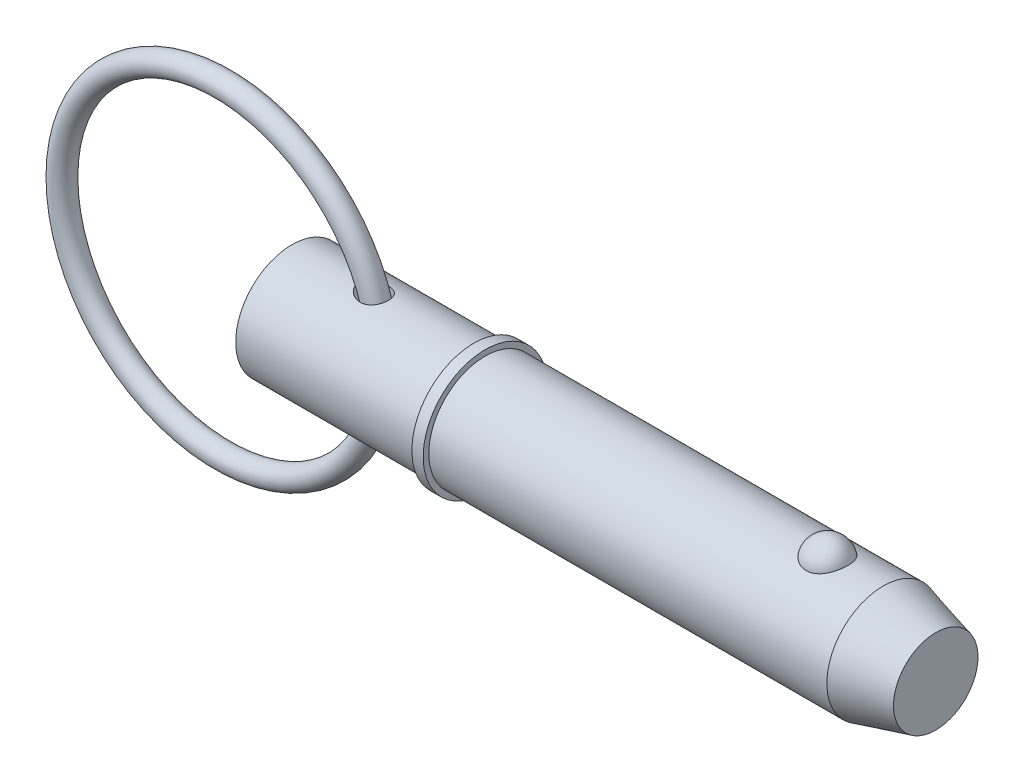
ISO-10303-21;
HEADER;
FILE_DESCRIPTION(('STEP AP214'),'2;1');
FILE_NAME('part.step','',(''),(''),'','','');
FILE_SCHEMA(('AUTOMOTIVE_DESIGN { 1 0 10303 214 1 1 1 1 }'));
ENDSEC;
DATA;
#1=APPLICATION_CONTEXT('core data for automotive mechanical design processes');
#2=APPLICATION_PROTOCOL_DEFINITION('international standard','automotive_design',2000,#1);
#3=PRODUCT_CONTEXT('',#1,'mechanical');
#4=PRODUCT('Part','Part','',(#3));
#5=PRODUCT_RELATED_PRODUCT_CATEGORY('part','',(#4));
#6=PRODUCT_DEFINITION_FORMATION('','',#4);
#7=PRODUCT_DEFINITION_CONTEXT('part definition',#1,'design');
#8=PRODUCT_DEFINITION('design','',#6,#7);
#9=PRODUCT_DEFINITION_SHAPE('','',#8);
#10=(LENGTH_UNIT() NAMED_UNIT(*) SI_UNIT(.MILLI.,.METRE.));
#11=(NAMED_UNIT(*) PLANE_ANGLE_UNIT() SI_UNIT($,.RADIAN.));
#12=(NAMED_UNIT(*) SI_UNIT($,.STERADIAN.) SOLID_ANGLE_UNIT());
#13=UNCERTAINTY_MEASURE_WITH_UNIT(LENGTH_MEASURE(1.E-05),#10,'distance_accuracy_value','');
#14=(GEOMETRIC_REPRESENTATION_CONTEXT(3) GLOBAL_UNCERTAINTY_ASSIGNED_CONTEXT((#13)) GLOBAL_UNIT_ASSIGNED_CONTEXT((#10,
#11,#12)) REPRESENTATION_CONTEXT('',''));
#15=CARTESIAN_POINT('',(0.,0.,0.));
#16=DIRECTION('',(0.,0.,1.));
#17=DIRECTION('',(1.,0.,0.));
#18=AXIS2_PLACEMENT_3D('',#15,#16,#17);
#19=CARTESIAN_POINT('',(-13.640845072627,0.,0.));
#20=DIRECTION('',(0.,0.,1.));
#21=DIRECTION('',(1.,0.,0.));
#22=AXIS2_PLACEMENT_3D('',#19,#20,#21);
#23=TOROIDAL_SURFACE('',#22,31.75,2.223);
#24=CARTESIAN_POINT('',(20.332154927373,0.,0.));
#25=VERTEX_POINT('',#24);
#26=VERTEX_LOOP('',#25);
#27=FACE_BOUND('',#26,.T.);
#28=ADVANCED_FACE('P0_F12',(#27),#23,.T.);
#29=CLOSED_SHELL('',(#28));
#30=MANIFOLD_SOLID_BREP('P0_B1',#29);
#31=CARTESIAN_POINT('',(0.,0.,0.));
#32=DIRECTION('',(1.,0.,0.));
#33=DIRECTION('',(0.,0.,-1.));
#34=AXIS2_PLACEMENT_3D('',#31,#32,#33);
#35=CYLINDRICAL_SURFACE('',#34,11.115);
#36=CARTESIAN_POINT('',(13.5245830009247,11.0328953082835,-1.34849772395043));
#37=CARTESIAN_POINT('',(13.6190616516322,11.0150940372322,-1.49413162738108));
#38=CARTESIAN_POINT('',(13.7272589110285,10.9954577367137,-1.63076546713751));
#39=CARTESIAN_POINT('',(13.9654537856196,10.9550099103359,-1.8834727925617));
#40=CARTESIAN_POINT('',(14.0954990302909,10.9341958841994,-1.99950019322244));
#41=CARTESIAN_POINT('',(14.3718600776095,10.893854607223,-2.20871939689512));
#42=CARTESIAN_POINT('',(14.5180879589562,10.8743212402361,-2.30202655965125));
#43=CARTESIAN_POINT('',(14.8233821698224,10.8385071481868,-2.46515115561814));
#44=CARTESIAN_POINT('',(14.9824448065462,10.8222254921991,-2.53497531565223));
#45=CARTESIAN_POINT('',(15.3233581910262,10.7936101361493,-2.65430007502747));
#46=CARTESIAN_POINT('',(15.5060064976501,10.7817126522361,-2.7016502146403));
#47=CARTESIAN_POINT('',(15.8771124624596,10.7657570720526,-2.76455948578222));
#48=CARTESIAN_POINT('',(16.0655695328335,10.7616981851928,-2.78012182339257));
#49=CARTESIAN_POINT('',(16.4345152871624,10.7624400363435,-2.77724928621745));
#50=CARTESIAN_POINT('',(16.6150121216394,10.7668823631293,-2.76018977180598));
#51=CARTESIAN_POINT('',(16.9695132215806,10.7837407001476,-2.69357457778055));
#52=CARTESIAN_POINT('',(17.1435222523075,10.7961507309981,-2.64404326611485));
#53=CARTESIAN_POINT('',(17.4621418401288,10.8258984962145,-2.51928348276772));
#54=CARTESIAN_POINT('',(17.6079677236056,10.8426430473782,-2.44700611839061));
#55=CARTESIAN_POINT('',(17.884162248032,10.8794194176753,-2.27791740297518));
#56=CARTESIAN_POINT('',(18.0145349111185,10.8994503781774,-2.18111245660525));
#57=CARTESIAN_POINT('',(18.2494965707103,10.9392822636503,-1.9713196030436));
#58=CARTESIAN_POINT('',(18.3550661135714,10.9590421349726,-1.85941863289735));
#59=CARTESIAN_POINT('',(18.5458147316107,10.9970986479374,-1.61919918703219));
#60=CARTESIAN_POINT('',(18.6309947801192,11.0153953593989,-1.49088149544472));
#61=CARTESIAN_POINT('',(18.7786686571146,11.0484675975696,-1.2218388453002));
#62=CARTESIAN_POINT('',(18.8412214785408,11.063252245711,-1.08114735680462));
#63=CARTESIAN_POINT('',(18.9425265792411,11.0877718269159,-0.791025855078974));
#64=CARTESIAN_POINT('',(18.9812780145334,11.0975065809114,-0.641595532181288));
#65=CARTESIAN_POINT('',(19.0343305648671,11.1109435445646,-0.336997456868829));
#66=CARTESIAN_POINT('',(19.0484404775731,11.1145985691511,-0.181794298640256));
#67=CARTESIAN_POINT('',(19.0513147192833,11.1153384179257,0.1288646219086));
#68=CARTESIAN_POINT('',(19.0400783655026,11.112423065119,0.284320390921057));
#69=CARTESIAN_POINT('',(18.9924362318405,11.1003163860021,0.591525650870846));
#70=CARTESIAN_POINT('',(18.9559600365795,11.0911075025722,0.743263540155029));
#71=CARTESIAN_POINT('',(18.858576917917,11.0673920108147,1.03825247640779));
#72=CARTESIAN_POINT('',(18.7976699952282,11.0528854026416,1.18150352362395));
#73=CARTESIAN_POINT('',(18.6529960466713,11.020201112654,1.45511394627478));
#74=CARTESIAN_POINT('',(18.5692772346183,11.0020311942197,1.58549973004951));
#75=CARTESIAN_POINT('',(18.3810003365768,10.9640237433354,1.82995492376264));
#76=CARTESIAN_POINT('',(18.2764441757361,10.9441863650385,1.9440258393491));
#77=CARTESIAN_POINT('',(18.0501398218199,10.9052267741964,2.15183128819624));
#78=CARTESIAN_POINT('',(17.9285270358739,10.8861003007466,2.24571250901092));
#79=CARTESIAN_POINT('',(17.6709592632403,10.8505244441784,2.41175942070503));
#80=CARTESIAN_POINT('',(17.5350055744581,10.8340748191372,2.48392707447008));
#81=CARTESIAN_POINT('',(17.2528390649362,10.8056099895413,2.60497667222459));
#82=CARTESIAN_POINT('',(17.1066353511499,10.7935909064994,2.65387899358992));
#83=CARTESIAN_POINT('',(16.8080326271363,10.7750969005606,2.72799859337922));
#84=CARTESIAN_POINT('',(16.6556326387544,10.7686228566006,2.75321211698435));
#85=CARTESIAN_POINT('',(16.3428877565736,10.761517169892,2.78086153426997));
#86=CARTESIAN_POINT('',(16.1824599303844,10.7611149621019,2.78240297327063));
#87=CARTESIAN_POINT('',(15.863296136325,10.766478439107,2.76156874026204));
#88=CARTESIAN_POINT('',(15.7045607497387,10.7722461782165,2.73918510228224));
#89=CARTESIAN_POINT('',(15.3787211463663,10.7898500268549,2.66904167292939));
#90=CARTESIAN_POINT('',(15.2120794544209,10.8021675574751,2.6192557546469));
#91=CARTESIAN_POINT('',(14.8886284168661,10.8315482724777,2.4949635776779));
#92=CARTESIAN_POINT('',(14.731827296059,10.8486153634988,2.42043695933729));
#93=CARTESIAN_POINT('',(14.4198762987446,10.8870804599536,2.24137362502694));
#94=CARTESIAN_POINT('',(14.2658484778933,10.9087148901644,2.13492229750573));
#95=CARTESIAN_POINT('',(13.9788214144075,10.9526299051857,1.89676517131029));
#96=CARTESIAN_POINT('',(13.845804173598,10.9749099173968,1.76508120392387));
#97=CARTESIAN_POINT('',(13.6310853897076,11.012885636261,1.50762337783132));
#98=CARTESIAN_POINT('',(13.5444453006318,11.0290026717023,1.38602082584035));
#99=CARTESIAN_POINT('',(13.392158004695,11.0581740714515,1.12983363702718));
#100=CARTESIAN_POINT('',(13.3264946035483,11.0712307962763,0.995259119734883));
#101=CARTESIAN_POINT('',(13.2464179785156,11.0874250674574,0.785640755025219));
#102=CARTESIAN_POINT('',(13.2227369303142,11.0922707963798,0.71416661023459));
#103=CARTESIAN_POINT('',(13.1820656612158,11.1006486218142,0.56927708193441));
#104=CARTESIAN_POINT('',(13.1650721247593,11.1041813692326,0.495862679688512));
#105=CARTESIAN_POINT('',(13.1381118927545,11.1098070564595,0.34771199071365));
#106=CARTESIAN_POINT('',(13.1281436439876,11.1119003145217,0.272975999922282));
#107=CARTESIAN_POINT('',(13.1154243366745,11.1145746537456,0.122890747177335));
#108=CARTESIAN_POINT('',(13.1126723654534,11.1151559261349,0.0475415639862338));
#109=CARTESIAN_POINT('',(13.1151602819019,11.1146296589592,-0.160384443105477));
#110=CARTESIAN_POINT('',(13.128061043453,11.111903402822,-0.292944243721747));
#111=CARTESIAN_POINT('',(13.175691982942,11.1019662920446,-0.553751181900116));
#112=CARTESIAN_POINT('',(13.2104121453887,11.094757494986,-0.682000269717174));
#113=CARTESIAN_POINT('',(13.2891255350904,11.0787645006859,-0.901873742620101));
#114=CARTESIAN_POINT('',(13.3290466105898,11.0707438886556,-0.995044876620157));
#115=CARTESIAN_POINT('',(13.4192915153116,11.0529876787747,-1.175992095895));
#116=CARTESIAN_POINT('',(13.4696154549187,11.0432520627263,-1.26376812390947));
#117=CARTESIAN_POINT('',(13.5245830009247,11.0328953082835,-1.34849772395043));
#118=B_SPLINE_CURVE_WITH_KNOTS('',3,(#36,#37,#38,#39,#40,#41,#42,#43,#44,#45,#46,#47,#48,#49,
#50,#51,#52,#53,#54,#55,#56,#57,#58,#59,#60,#61,#62,#63,#64,#65,#66,#67,#68,#69,#70,#71,#72,#73,
#74,#75,#76,#77,#78,#79,#80,#81,#82,#83,#84,#85,#86,#87,#88,#89,#90,#91,#92,#93,#94,#95,#96,#97,
#98,#99,#100,#101,#102,#103,#104,#105,#106,#107,#108,#109,#110,#111,#112,#113,#114,#115,#116,
#117),.UNSPECIFIED.,.T.,.F.,(4,2,2,2,2,2,2,2,2,2,2,2,2,2,2,2,2,2,2,2,2,2,2,2,2,2,2,2,2,2,2,2,2,
2,2,2,2,2,2,2,4),(0.,0.523099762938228,1.04735506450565,1.5688902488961,2.09027590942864,
2.65465173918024,3.21897064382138,3.76002078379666,4.30066536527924,4.78898318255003,
5.27717362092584,5.74028268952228,6.20336964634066,6.66524040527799,7.12712754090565,
7.59258295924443,8.05805091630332,8.52482272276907,8.99159451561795,9.45738731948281,
9.92313710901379,10.3853792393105,10.8475795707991,11.3093743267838,11.771242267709,
12.2505208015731,12.7299589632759,13.2508366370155,13.7721440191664,14.334890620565,
14.8971525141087,15.3459336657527,15.7943675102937,16.0204422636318,16.2464047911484,
16.4723173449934,16.6982013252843,17.095711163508,17.4930386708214,17.7973741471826,
18.1017128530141),.UNSPECIFIED.);
#119=CARTESIAN_POINT('',(13.5245830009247,11.0328953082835,-1.34849772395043));
#120=VERTEX_POINT('',#119);
#121=EDGE_CURVE('P1_E42',#120,#120,#118,.T.);
#122=ORIENTED_EDGE('',*,*,#121,.T.);
#123=EDGE_LOOP('',(#122));
#124=FACE_BOUND('',#123,.T.);
#125=CARTESIAN_POINT('',(0.,0.,0.));
#126=DIRECTION('',(1.,0.,0.));
#127=DIRECTION('',(0.,0.,-1.));
#128=AXIS2_PLACEMENT_3D('',#125,#126,#127);
#129=CIRCLE('',#128,11.115);
#130=CARTESIAN_POINT('',(0.,0.,-11.115));
#131=VERTEX_POINT('',#130);
#132=EDGE_CURVE('P1_E9',#131,#131,#129,.T.);
#133=ORIENTED_EDGE('',*,*,#132,.T.);
#134=EDGE_LOOP('',(#133));
#135=FACE_BOUND('',#134,.T.);
#136=CARTESIAN_POINT('',(35.877,0.,0.));
#137=DIRECTION('',(1.,0.,0.));
#138=DIRECTION('',(0.,0.,-1.));
#139=AXIS2_PLACEMENT_3D('',#136,#137,#138);
#140=CIRCLE('',#139,11.115);
#141=CARTESIAN_POINT('',(35.877,0.,-11.115));
#142=VERTEX_POINT('',#141);
#143=EDGE_CURVE('P1_E25',#142,#142,#140,.T.);
#144=ORIENTED_EDGE('',*,*,#143,.F.);
#145=EDGE_LOOP('',(#144));
#146=FACE_BOUND('',#145,.T.);
#147=CARTESIAN_POINT('',(13.5245830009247,-11.0328953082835,-1.34849772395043));
#148=CARTESIAN_POINT('',(13.449887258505,-11.0469690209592,-1.233356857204));
#149=CARTESIAN_POINT('',(13.3837464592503,-11.0598986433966,-1.11255897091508));
#150=CARTESIAN_POINT('',(13.271526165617,-11.0822620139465,-0.861680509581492));
#151=CARTESIAN_POINT('',(13.2254273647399,-11.0916991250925,-0.731609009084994));
#152=CARTESIAN_POINT('',(13.1557497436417,-11.1060943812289,-0.464578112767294));
#153=CARTESIAN_POINT('',(13.1322820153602,-11.111030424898,-0.327588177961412));
#154=CARTESIAN_POINT('',(13.1098958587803,-11.1157368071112,-0.0515139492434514));
#155=CARTESIAN_POINT('',(13.1109730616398,-11.1155080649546,0.087569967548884));
#156=CARTESIAN_POINT('',(13.1367722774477,-11.110088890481,0.354927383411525));
#157=CARTESIAN_POINT('',(13.160070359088,-11.1051972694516,0.483348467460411));
#158=CARTESIAN_POINT('',(13.2268311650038,-11.091413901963,0.734581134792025));
#159=CARTESIAN_POINT('',(13.2702981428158,-11.0825213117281,0.857391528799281));
#160=CARTESIAN_POINT('',(13.3769008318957,-11.0612491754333,1.09871322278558));
#161=CARTESIAN_POINT('',(13.4406446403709,-11.048763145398,1.21694419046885));
#162=CARTESIAN_POINT('',(13.5844860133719,-11.0215642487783,1.44267020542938));
#163=CARTESIAN_POINT('',(13.6645903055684,-11.0068504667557,1.55016080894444));
#164=CARTESIAN_POINT('',(13.8511803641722,-10.9741237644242,1.76795565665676));
#165=CARTESIAN_POINT('',(13.959808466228,-10.9559422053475,1.87639683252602));
#166=CARTESIAN_POINT('',(14.1916437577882,-10.9197998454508,2.07642617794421));
#167=CARTESIAN_POINT('',(14.3148607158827,-10.901839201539,2.16800294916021));
#168=CARTESIAN_POINT('',(14.5931107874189,-10.8649902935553,2.34622033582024));
#169=CARTESIAN_POINT('',(14.7501095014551,-10.8463937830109,2.42986679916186));
#170=CARTESIAN_POINT('',(15.0757118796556,-10.8136392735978,2.57171975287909));
#171=CARTESIAN_POINT('',(15.2443214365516,-10.7994835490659,2.62991321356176));
#172=CARTESIAN_POINT('',(15.599068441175,-10.7767894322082,2.72147498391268));
#173=CARTESIAN_POINT('',(15.7856559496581,-10.768622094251,2.75321798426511));
#174=CARTESIAN_POINT('',(16.1617095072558,-10.7608206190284,2.78356776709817));
#175=CARTESIAN_POINT('',(16.3511739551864,-10.7611818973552,2.78219235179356));
#176=CARTESIAN_POINT('',(16.7138126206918,-10.7705428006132,2.7457129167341));
#177=CARTESIAN_POINT('',(16.8872269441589,-10.7789612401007,2.71287798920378));
#178=CARTESIAN_POINT('',(17.2247245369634,-10.8028011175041,2.61632772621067));
#179=CARTESIAN_POINT('',(17.3888134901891,-10.8182182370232,2.55263143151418));
#180=CARTESIAN_POINT('',(17.6871641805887,-10.8524191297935,2.40281428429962));
#181=CARTESIAN_POINT('',(17.8227812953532,-10.8707652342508,2.31928155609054));
#182=CARTESIAN_POINT('',(18.0770765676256,-10.9094513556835,2.12988301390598));
#183=CARTESIAN_POINT('',(18.1957578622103,-10.9297910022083,2.02402134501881));
#184=CARTESIAN_POINT('',(18.4088055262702,-10.9693230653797,1.79719870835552));
#185=CARTESIAN_POINT('',(18.5038890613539,-10.9885305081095,1.67691225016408));
#186=CARTESIAN_POINT('',(18.6726701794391,-11.0244347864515,1.42183894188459));
#187=CARTESIAN_POINT('',(18.7463681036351,-11.0411316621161,1.28705232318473));
#188=CARTESIAN_POINT('',(18.8708297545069,-11.0702507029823,1.00634471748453));
#189=CARTESIAN_POINT('',(18.9215212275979,-11.0826593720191,0.860390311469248));
#190=CARTESIAN_POINT('',(18.9984973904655,-11.1017993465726,0.561823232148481));
#191=CARTESIAN_POINT('',(19.0247811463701,-11.1085304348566,0.409210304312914));
#192=CARTESIAN_POINT('',(19.0524622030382,-11.1156244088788,0.100537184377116));
#193=CARTESIAN_POINT('',(19.0536873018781,-11.1159432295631,-0.0555394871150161));
#194=CARTESIAN_POINT('',(19.0307837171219,-11.110065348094,-0.365700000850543));
#195=CARTESIAN_POINT('',(19.0066544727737,-11.1038685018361,-0.519783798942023));
#196=CARTESIAN_POINT('',(18.9335163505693,-11.0856111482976,-0.821817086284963));
#197=CARTESIAN_POINT('',(18.8844701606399,-11.0735418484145,-0.969757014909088));
#198=CARTESIAN_POINT('',(18.7625929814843,-11.0448501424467,-1.25502066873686));
#199=CARTESIAN_POINT('',(18.6897623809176,-11.0282278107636,-1.39234456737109));
#200=CARTESIAN_POINT('',(18.522359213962,-10.9923333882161,-1.65195905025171));
#201=CARTESIAN_POINT('',(18.427863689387,-10.9730707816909,-1.77430060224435));
#202=CARTESIAN_POINT('',(18.2194216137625,-10.9340072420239,-2.00099176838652));
#203=CARTESIAN_POINT('',(18.1054772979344,-10.9142063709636,-2.10534344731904));
#204=CARTESIAN_POINT('',(17.8622613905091,-10.8764452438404,-2.2924289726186));
#205=CARTESIAN_POINT('',(17.7331196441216,-10.8584715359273,-2.3753290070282));
#206=CARTESIAN_POINT('',(17.4625069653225,-10.8261386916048,-2.51860389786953));
#207=CARTESIAN_POINT('',(17.3210365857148,-10.8117793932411,-2.57897976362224));
#208=CARTESIAN_POINT('',(17.0290309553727,-10.7880576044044,-2.67648805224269));
#209=CARTESIAN_POINT('',(16.8784484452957,-10.7787241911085,-2.71348542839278));
#210=CARTESIAN_POINT('',(16.573148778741,-10.7659618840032,-2.7636855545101));
#211=CARTESIAN_POINT('',(16.4184306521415,-10.7625343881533,-2.77688267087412));
#212=CARTESIAN_POINT('',(16.1008073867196,-10.761643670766,-2.78033419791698));
#213=CARTESIAN_POINT('',(15.9378898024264,-10.7644957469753,-2.76937572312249));
#214=CARTESIAN_POINT('',(15.6157286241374,-10.7762062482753,-2.72344300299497));
#215=CARTESIAN_POINT('',(15.4564861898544,-10.7850665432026,-2.68846128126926));
#216=CARTESIAN_POINT('',(15.1305734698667,-10.808737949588,-2.59174021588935));
#217=CARTESIAN_POINT('',(14.9645834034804,-10.8240246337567,-2.52782071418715));
#218=CARTESIAN_POINT('',(14.6448218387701,-10.8585969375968,-2.37491543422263));
#219=CARTESIAN_POINT('',(14.4910653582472,-10.8778873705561,-2.28589943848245));
#220=CARTESIAN_POINT('',(14.1837929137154,-10.920550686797,-2.07312951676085));
#221=CARTESIAN_POINT('',(14.0321999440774,-10.9441390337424,-1.94661563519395));
#222=CARTESIAN_POINT('',(13.756115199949,-10.9902311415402,-1.66673537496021));
#223=CARTESIAN_POINT('',(13.6315733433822,-11.0127368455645,-1.51341958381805));
#224=CARTESIAN_POINT('',(13.5245830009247,-11.0328953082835,-1.34849772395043));
#225=B_SPLINE_CURVE_WITH_KNOTS('',3,(#147,#148,#149,#150,#151,#152,#153,#154,#155,#156,#157,
#158,#159,#160,#161,#162,#163,#164,#165,#166,#167,#168,#169,#170,#171,#172,#173,#174,#175,#176,
#177,#178,#179,#180,#181,#182,#183,#184,#185,#186,#187,#188,#189,#190,#191,#192,#193,#194,#195,
#196,#197,#198,#199,#200,#201,#202,#203,#204,#205,#206,#207,#208,#209,#210,#211,#212,#213,#214,
#215,#216,#217,#218,#219,#220,#221,#222,#223,#224),.UNSPECIFIED.,.T.,.F.,(4,2,2,2,2,2,2,2,2,2,2,
2,2,2,2,2,2,2,2,2,2,2,2,2,2,2,2,2,2,2,2,2,2,2,2,2,2,2,4),(0.,0.413394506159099,
0.826389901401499,1.24140245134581,1.65634113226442,2.04635967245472,2.43646050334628,
2.83958259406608,3.24287078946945,3.70479277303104,4.16702582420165,4.70130512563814,
5.23585761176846,5.80123945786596,6.36631739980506,6.89348344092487,7.42032464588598,
7.8989135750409,8.37741373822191,8.83881993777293,9.30021877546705,9.76305681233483,
10.2259125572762,10.6919479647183,11.1579936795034,11.6247393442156,12.0914773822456,
12.55658073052,13.0216306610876,13.4829619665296,13.9442725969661,14.408224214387,
14.8722856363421,15.3601762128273,15.8482186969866,16.3815107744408,16.9154477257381,
17.5086806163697,18.1008056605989),.UNSPECIFIED.);
#226=CARTESIAN_POINT('',(13.5245830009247,-11.0328953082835,-1.34849772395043));
#227=VERTEX_POINT('',#226);
#228=EDGE_CURVE('P1_E17',#227,#227,#225,.T.);
#229=ORIENTED_EDGE('',*,*,#228,.T.);
#230=EDGE_LOOP('',(#229));
#231=FACE_BOUND('',#230,.T.);
#232=ADVANCED_FACE('P1_F13',(#124,#135,#146,#231),#35,.T.);
#233=CARTESIAN_POINT('',(0.,0.,0.));
#234=DIRECTION('',(1.,0.,0.));
#235=DIRECTION('',(0.,0.,-1.));
#236=AXIS2_PLACEMENT_3D('',#233,#234,#235);
#237=CYLINDRICAL_SURFACE('',#236,11.115);
#238=CARTESIAN_POINT('',(116.629563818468,0.,0.));
#239=DIRECTION('',(1.,0.,0.));
#240=DIRECTION('',(0.,0.,-1.));
#241=AXIS2_PLACEMENT_3D('',#238,#239,#240);
#242=CIRCLE('',#241,11.115);
#243=CARTESIAN_POINT('',(116.629563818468,0.,-11.115));
#244=VERTEX_POINT('',#243);
#245=EDGE_CURVE('P1_E99',#244,#244,#242,.T.);
#246=ORIENTED_EDGE('',*,*,#245,.F.);
#247=EDGE_LOOP('',(#246));
#248=FACE_BOUND('',#247,.T.);
#249=CARTESIAN_POINT('',(38.1,0.,0.));
#250=DIRECTION('',(1.,0.,0.));
#251=DIRECTION('',(0.,0.,-1.));
#252=AXIS2_PLACEMENT_3D('',#249,#250,#251);
#253=CIRCLE('',#252,11.115);
#254=CARTESIAN_POINT('',(38.1,0.,-11.115));
#255=VERTEX_POINT('',#254);
#256=EDGE_CURVE('P1_E96',#255,#255,#253,.T.);
#257=ORIENTED_EDGE('',*,*,#256,.T.);
#258=EDGE_LOOP('',(#257));
#259=FACE_BOUND('',#258,.T.);
#260=CARTESIAN_POINT('',(105.631068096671,10.3028087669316,4.17077409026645));
#261=CARTESIAN_POINT('',(105.414775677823,10.3028003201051,4.17078240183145));
#262=CARTESIAN_POINT('',(105.198548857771,10.3098895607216,4.15340593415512));
#263=CARTESIAN_POINT('',(104.772540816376,10.3373834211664,4.08449540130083));
#264=CARTESIAN_POINT('',(104.562757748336,10.3577841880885,4.03297121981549));
#265=CARTESIAN_POINT('',(104.155782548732,10.4095237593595,3.89746513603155));
#266=CARTESIAN_POINT('',(103.958572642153,10.4408466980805,3.81353029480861));
#267=CARTESIAN_POINT('',(103.581338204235,10.5110236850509,3.61560339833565));
#268=CARTESIAN_POINT('',(103.401317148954,10.5498792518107,3.50160528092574));
#269=CARTESIAN_POINT('',(103.057684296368,10.6322884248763,3.24292464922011));
#270=CARTESIAN_POINT('',(102.894686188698,10.6759443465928,3.09746040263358));
#271=CARTESIAN_POINT('',(102.594591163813,10.7625291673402,2.78171925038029));
#272=CARTESIAN_POINT('',(102.457499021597,10.8054579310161,2.61143778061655));
#273=CARTESIAN_POINT('',(102.206408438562,10.8881935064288,2.24226695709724));
#274=CARTESIAN_POINT('',(102.093710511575,10.9277761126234,2.04244123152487));
#275=CARTESIAN_POINT('',(101.901777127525,10.997484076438,1.62578254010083));
#276=CARTESIAN_POINT('',(101.822544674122,11.0276085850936,1.40894804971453));
#277=CARTESIAN_POINT('',(101.698303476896,11.0756732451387,0.961250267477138));
#278=CARTESIAN_POINT('',(101.653760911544,11.0934470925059,0.730239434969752));
#279=CARTESIAN_POINT('',(101.601569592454,11.1143331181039,0.263439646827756));
#280=CARTESIAN_POINT('',(101.593920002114,11.1174456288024,0.0276507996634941));
#281=CARTESIAN_POINT('',(101.61561056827,11.1087161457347,-0.440729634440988));
#282=CARTESIAN_POINT('',(101.644762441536,11.0969502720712,-0.673331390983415));
#283=CARTESIAN_POINT('',(101.739143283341,11.0597872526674,-1.12996621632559));
#284=CARTESIAN_POINT('',(101.804372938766,11.0343898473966,-1.35399912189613));
#285=CARTESIAN_POINT('',(101.96969844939,10.972515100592,-1.78750286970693));
#286=CARTESIAN_POINT('',(102.06983863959,10.9360236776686,-1.99695478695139));
#287=CARTESIAN_POINT('',(102.302940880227,10.8557595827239,-2.3952066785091));
#288=CARTESIAN_POINT('',(102.435905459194,10.8119863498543,-2.58400506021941));
#289=CARTESIAN_POINT('',(102.732407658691,10.7216733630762,-2.93635726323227));
#290=CARTESIAN_POINT('',(102.896056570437,10.675123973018,-3.09981510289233));
#291=CARTESIAN_POINT('',(103.249860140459,10.5846571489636,-3.39592247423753));
#292=CARTESIAN_POINT('',(103.440012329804,10.5407394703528,-3.52857487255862));
#293=CARTESIAN_POINT('',(103.83750141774,10.4616690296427,-3.75646057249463));
#294=CARTESIAN_POINT('',(104.04436705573,10.4263443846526,-3.85245432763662));
#295=CARTESIAN_POINT('',(104.472954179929,10.3675574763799,-4.0079874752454));
#296=CARTESIAN_POINT('',(104.694670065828,10.3440907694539,-4.06754052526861));
#297=CARTESIAN_POINT('',(105.134669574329,10.3128282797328,-4.14614314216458));
#298=CARTESIAN_POINT('',(105.352565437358,10.3043040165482,-4.1670783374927));
#299=CARTESIAN_POINT('',(105.78894951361,10.3016771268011,-4.17357158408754));
#300=CARTESIAN_POINT('',(106.007437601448,10.3075716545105,-4.15913661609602));
#301=CARTESIAN_POINT('',(106.431744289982,10.3326686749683,-4.09636961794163));
#302=CARTESIAN_POINT('',(106.637745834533,10.3514555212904,-4.0490957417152));
#303=CARTESIAN_POINT('',(107.038576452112,10.399818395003,-3.92320197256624));
#304=CARTESIAN_POINT('',(107.2334046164,10.4293952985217,-3.84457953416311));
#305=CARTESIAN_POINT('',(107.611191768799,10.4969600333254,-3.65612410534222));
#306=CARTESIAN_POINT('',(107.793797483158,10.5351178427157,-3.54564545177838));
#307=CARTESIAN_POINT('',(108.138204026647,10.6154999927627,-3.29718036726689));
#308=CARTESIAN_POINT('',(108.300000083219,10.657725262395,-3.15918764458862));
#309=CARTESIAN_POINT('',(108.606959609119,10.744212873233,-2.85163580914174));
#310=CARTESIAN_POINT('',(108.750891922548,10.7884718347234,-2.68084605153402));
#311=CARTESIAN_POINT('',(109.009237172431,10.872374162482,-2.3172186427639));
#312=CARTESIAN_POINT('',(109.123644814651,10.9120167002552,-2.12437704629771));
#313=CARTESIAN_POINT('',(109.323873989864,10.9838919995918,-1.71516999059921));
#314=CARTESIAN_POINT('',(109.40866178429,11.0158465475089,-1.49824866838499));
#315=CARTESIAN_POINT('',(109.54268382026,11.0673523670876,-1.05228572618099));
#316=CARTESIAN_POINT('',(109.591917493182,11.086903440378,-0.823243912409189));
#317=CARTESIAN_POINT('',(109.653891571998,11.1116323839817,-0.359087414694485));
#318=CARTESIAN_POINT('',(109.666566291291,11.1167843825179,-0.123962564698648));
#319=CARTESIAN_POINT('',(109.654973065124,11.1121144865,0.345220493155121));
#320=CARTESIAN_POINT('',(109.630705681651,11.1022928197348,0.579278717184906));
#321=CARTESIAN_POINT('',(109.545907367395,11.0687504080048,1.03866534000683));
#322=CARTESIAN_POINT('',(109.485529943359,11.0450885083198,1.26402641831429));
#323=CARTESIAN_POINT('',(109.329853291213,10.9863185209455,1.70076772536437));
#324=CARTESIAN_POINT('',(109.234551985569,10.9512097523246,1.91214712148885));
#325=CARTESIAN_POINT('',(109.010397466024,10.8729733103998,2.31608359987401));
#326=CARTESIAN_POINT('',(108.881380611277,10.8298068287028,2.50854240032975));
#327=CARTESIAN_POINT('',(108.592732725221,10.7401896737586,2.86808766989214));
#328=CARTESIAN_POINT('',(108.433102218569,10.6937390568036,3.03517457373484));
#329=CARTESIAN_POINT('',(108.087534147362,10.6029321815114,3.33857581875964));
#330=CARTESIAN_POINT('',(107.901708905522,10.5585680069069,3.47501541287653));
#331=CARTESIAN_POINT('',(107.507875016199,10.4769321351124,3.71390897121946));
#332=CARTESIAN_POINT('',(107.299863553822,10.439661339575,3.81635861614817));
#333=CARTESIAN_POINT('',(106.854066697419,10.3749407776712,3.98910631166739));
#334=CARTESIAN_POINT('',(106.615234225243,10.3482457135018,4.05700929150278));
#335=CARTESIAN_POINT('',(106.127925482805,10.312188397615,4.14782844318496));
#336=CARTESIAN_POINT('',(105.879453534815,10.3028184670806,4.17076454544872));
#337=CARTESIAN_POINT('',(105.631068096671,10.3028087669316,4.17077409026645));
#338=B_SPLINE_CURVE_WITH_KNOTS('',3,(#260,#261,#262,#263,#264,#265,#266,#267,#268,#269,#270,
#271,#272,#273,#274,#275,#276,#277,#278,#279,#280,#281,#282,#283,#284,#285,#286,#287,#288,#289,
#290,#291,#292,#293,#294,#295,#296,#297,#298,#299,#300,#301,#302,#303,#304,#305,#306,#307,#308,
#309,#310,#311,#312,#313,#314,#315,#316,#317,#318,#319,#320,#321,#322,#323,#324,#325,#326,#327,
#328,#329,#330,#331,#332,#333,#334,#335,#336,#337),.UNSPECIFIED.,.T.,.F.,(4,2,2,2,2,2,2,2,2,2,2,
2,2,2,2,2,2,2,2,2,2,2,2,2,2,2,2,2,2,2,2,2,2,2,2,2,2,2,4),(0.,0.647966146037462,1.29574482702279,
1.94258643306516,2.58955857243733,3.25496465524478,3.92049326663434,4.61566368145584,
5.31089647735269,6.01531821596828,6.71972398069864,7.42054043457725,8.12137023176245,
8.82309331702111,9.52487047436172,10.2292439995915,10.9335519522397,11.6223330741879,
12.3108558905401,12.9647664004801,13.6185478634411,14.2521847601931,14.8858731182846,
15.5334360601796,16.1811472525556,16.8611459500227,17.5412664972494,18.2431855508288,
18.9451158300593,19.6483065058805,20.3514864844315,21.0516982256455,21.7519516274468,
22.4556690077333,23.1593743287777,23.8601491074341,24.5610129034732,25.3054529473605,
26.049562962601),.UNSPECIFIED.);
#339=CARTESIAN_POINT('',(105.631068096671,10.3028087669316,4.17077409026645));
#340=VERTEX_POINT('',#339);
#341=EDGE_CURVE('P1_E34',#340,#340,#338,.T.);
#342=ORIENTED_EDGE('',*,*,#341,.T.);
#343=EDGE_LOOP('',(#342));
#344=FACE_BOUND('',#343,.T.);
#345=ADVANCED_FACE('P1_F46',(#248,#259,#344),#237,.T.);
#346=CARTESIAN_POINT('',(0.,0.,0.));
#347=DIRECTION('',(-1.,0.,0.));
#348=DIRECTION('',(0.,0.,1.));
#349=AXIS2_PLACEMENT_3D('',#346,#347,#348);
#350=PLANE('',#349);
#351=ORIENTED_EDGE('',*,*,#132,.F.);
#352=EDGE_LOOP('',(#351));
#353=FACE_BOUND('',#352,.T.);
#354=ADVANCED_FACE('P1_F15',(#353),#350,.T.);
#355=CARTESIAN_POINT('',(35.877,11.115,0.));
#356=DIRECTION('',(-1.,0.,0.));
#357=DIRECTION('',(0.,0.,1.));
#358=AXIS2_PLACEMENT_3D('',#355,#356,#357);
#359=PLANE('',#358);
#360=ORIENTED_EDGE('',*,*,#143,.T.);
#361=EDGE_LOOP('',(#360));
#362=FACE_BOUND('',#361,.T.);
#363=CARTESIAN_POINT('',(35.877,0.,0.));
#364=DIRECTION('',(1.,0.,0.));
#365=DIRECTION('',(0.,0.,-1.));
#366=AXIS2_PLACEMENT_3D('',#363,#364,#365);
#367=CIRCLE('',#366,12.2265);
#368=CARTESIAN_POINT('',(35.877,0.,-12.2265));
#369=VERTEX_POINT('',#368);
#370=EDGE_CURVE('P1_E30',#369,#369,#367,.T.);
#371=ORIENTED_EDGE('',*,*,#370,.F.);
#372=EDGE_LOOP('',(#371));
#373=FACE_BOUND('',#372,.T.);
#374=ADVANCED_FACE('P1_F81',(#362,#373),#359,.T.);
#375=CARTESIAN_POINT('',(0.,0.,0.));
#376=DIRECTION('',(1.,0.,0.));
#377=DIRECTION('',(0.,0.,-1.));
#378=AXIS2_PLACEMENT_3D('',#375,#376,#377);
#379=CYLINDRICAL_SURFACE('',#378,12.2265);
#380=ORIENTED_EDGE('',*,*,#370,.T.);
#381=EDGE_LOOP('',(#380));
#382=FACE_BOUND('',#381,.T.);
#383=CARTESIAN_POINT('',(38.1,0.,0.));
#384=DIRECTION('',(1.,0.,0.));
#385=DIRECTION('',(0.,0.,-1.));
#386=AXIS2_PLACEMENT_3D('',#383,#384,#385);
#387=CIRCLE('',#386,12.2265);
#388=CARTESIAN_POINT('',(38.1,0.,-12.2265));
#389=VERTEX_POINT('',#388);
#390=EDGE_CURVE('P1_E95',#389,#389,#387,.T.);
#391=ORIENTED_EDGE('',*,*,#390,.F.);
#392=EDGE_LOOP('',(#391));
#393=FACE_BOUND('',#392,.T.);
#394=ADVANCED_FACE('P1_F68',(#382,#393),#379,.T.);
#395=CARTESIAN_POINT('',(38.1,12.2265,0.));
#396=DIRECTION('',(1.,0.,0.));
#397=DIRECTION('',(0.,0.,-1.));
#398=AXIS2_PLACEMENT_3D('',#395,#396,#397);
#399=PLANE('',#398);
#400=ORIENTED_EDGE('',*,*,#390,.T.);
#401=EDGE_LOOP('',(#400));
#402=FACE_BOUND('',#401,.T.);
#403=ORIENTED_EDGE('',*,*,#256,.F.);
#404=EDGE_LOOP('',(#403));
#405=FACE_BOUND('',#404,.T.);
#406=ADVANCED_FACE('P1_F62',(#402,#405),#399,.T.);
#407=CARTESIAN_POINT('',(127.,0.,0.));
#408=DIRECTION('',(-1.,0.,0.));
#409=DIRECTION('',(0.,0.,1.));
#410=AXIS2_PLACEMENT_3D('',#407,#408,#409);
#411=CONICAL_SURFACE('',#410,8.33625000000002,0.26179938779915);
#412=ORIENTED_EDGE('',*,*,#245,.T.);
#413=EDGE_LOOP('',(#412));
#414=FACE_BOUND('',#413,.T.);
#415=CARTESIAN_POINT('',(127.,0.,0.));
#416=DIRECTION('',(1.,0.,0.));
#417=DIRECTION('',(0.,0.,-1.));
#418=AXIS2_PLACEMENT_3D('',#415,#416,#417);
#419=CIRCLE('',#418,8.33625000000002);
#420=CARTESIAN_POINT('',(127.,0.,-8.33625000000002));
#421=VERTEX_POINT('',#420);
#422=EDGE_CURVE('P1_E41',#421,#421,#419,.T.);
#423=ORIENTED_EDGE('',*,*,#422,.F.);
#424=EDGE_LOOP('',(#423));
#425=FACE_BOUND('',#424,.T.);
#426=ADVANCED_FACE('P1_F59',(#414,#425),#411,.T.);
#427=CARTESIAN_POINT('',(127.,8.33625000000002,0.));
#428=DIRECTION('',(1.,0.,0.));
#429=DIRECTION('',(0.,0.,-1.));
#430=AXIS2_PLACEMENT_3D('',#427,#428,#429);
#431=PLANE('',#430);
#432=ORIENTED_EDGE('',*,*,#422,.T.);
#433=EDGE_LOOP('',(#432));
#434=FACE_BOUND('',#433,.T.);
#435=ADVANCED_FACE('P1_F55',(#434),#431,.T.);
#436=CARTESIAN_POINT('',(105.631068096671,10.0035,0.));
#437=DIRECTION('',(-1.,0.,0.));
#438=DIRECTION('',(0.,1.,0.));
#439=AXIS2_PLACEMENT_3D('',#436,#437,#438);
#440=SPHERICAL_SURFACE('',#439,4.18150000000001);
#441=ORIENTED_EDGE('',*,*,#341,.F.);
#442=EDGE_LOOP('',(#441));
#443=FACE_BOUND('',#442,.T.);
#444=ADVANCED_FACE('P1_F50',(#443),#440,.T.);
#445=CARTESIAN_POINT('',(-13.640845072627,0.,0.));
#446=DIRECTION('',(0.,0.,1.));
#447=DIRECTION('',(1.,0.,0.));
#448=AXIS2_PLACEMENT_3D('',#445,#446,#447);
#449=TOROIDAL_SURFACE('',#448,31.75,2.77875);
#450=ORIENTED_EDGE('',*,*,#228,.F.);
#451=EDGE_LOOP('',(#450));
#452=FACE_BOUND('',#451,.T.);
#453=ORIENTED_EDGE('',*,*,#121,.F.);
#454=EDGE_LOOP('',(#453));
#455=FACE_BOUND('',#454,.T.);
#456=ADVANCED_FACE('P1_F54',(#452,#455),#449,.F.);
#457=CLOSED_SHELL('',(#232,#345,#354,#374,#394,#406,#426,#435,#444,#456));
#458=MANIFOLD_SOLID_BREP('P1_B1',#457);
#459=ADVANCED_BREP_SHAPE_REPRESENTATION('',(#18,#30,#458),#14);
#460=SHAPE_DEFINITION_REPRESENTATION(#9,#459);
ENDSEC;
END-ISO-10303-21;
